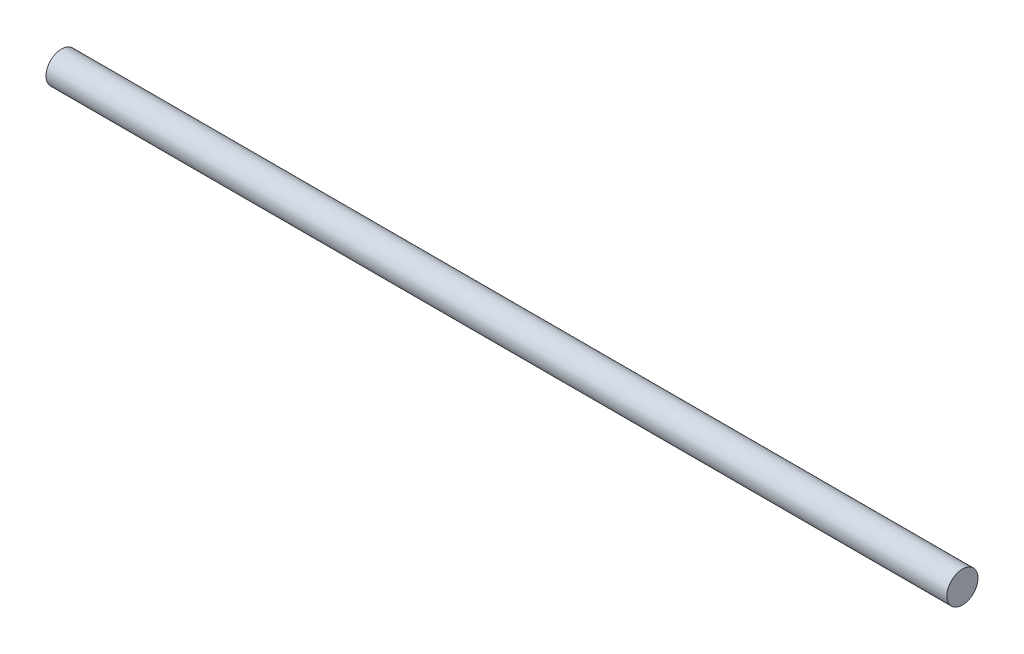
from build123d import *

# Parameters (mm, degrees)
SKETCH1_R         = 9.525
SCREWLENGTH_DEPTH = 550.164


with BuildPart() as part:
    # Sketch1 → SCREWLength (new body)
    with BuildSketch(Plane(origin=(0, 0, 0), x_dir=(0, 0, -1), z_dir=(1, 0, 0))):
        Circle(SKETCH1_R)
    extrude(amount=SCREWLENGTH_DEPTH)


solid = part.part
